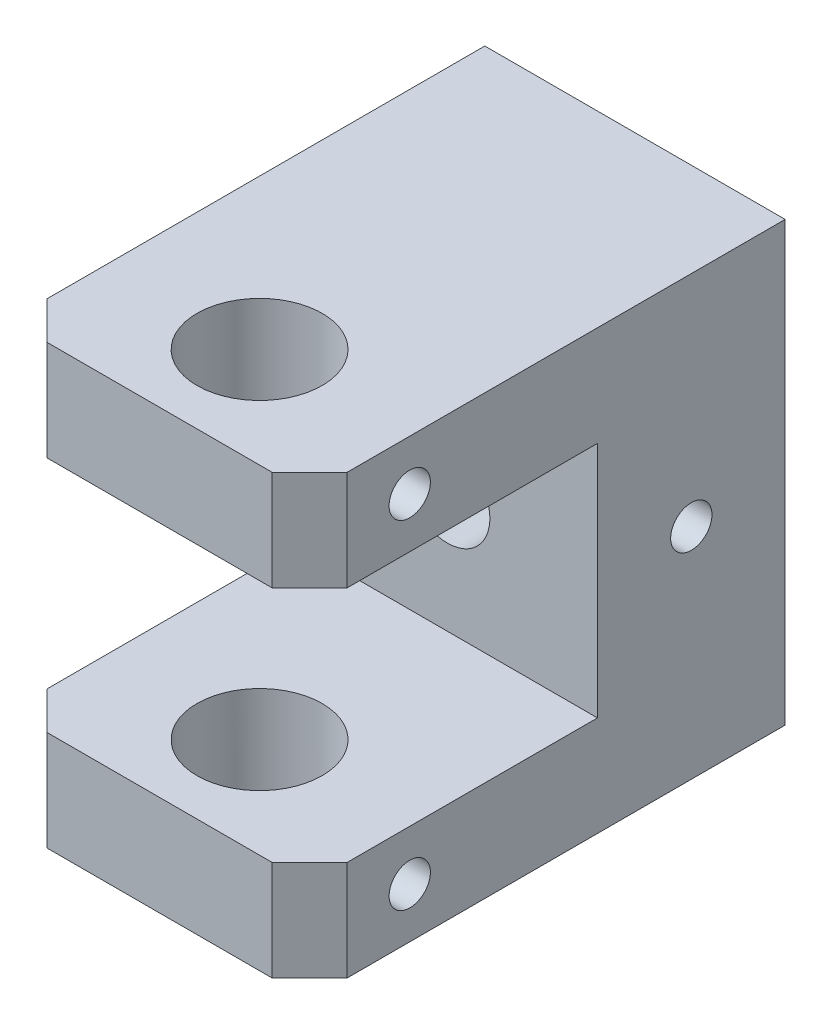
from build123d import *

# Parameters (mm, degrees)
SKETCH_1_W              = 24
SKETCH_1_H              = 38
EXTRUDE_1_DEPTH         = 17.5
SKETCH_2_W              = 23
SKETCH_2_H              = 19
CUT_EXTRUDE_1_DEPTH     = 49.231213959
HOLE_WIZARD_10_0_10_1_D = 10
HOLE_WIZARD_M8_1_D      = 6.8
HOLE_WIZARD_M8_1_DEPTH  = 19.75
HOLE_WIZARD_M8_1_TIP    = 2.042926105
HOLE_WIZARD_M4_1_REACH  = 50.231
HOLE_WIZARD_M4_1_BORE_R = 1.65
CHAMFER_1_SIZE          = 3
HOLE_WIZARD_M4_2_REACH  = 50.231
HOLE_WIZARD_M4_2_BORE_R = 1.65


with BuildPart() as part:
    # Sketch 1 → Extrude 1 (new, symmetric)
    with BuildSketch(Plane(origin=(0, 0, 0), x_dir=(1, 0, 0), z_dir=(0, 1, 0))):
        with Locations((0, -19)):
            Rectangle(SKETCH_1_W, SKETCH_1_H)
    extrude(amount=EXTRUDE_1_DEPTH, both=True)

    # Sketch 2 → Cut-Extrude 1 (cut, through all)
    with BuildSketch(Plane(origin=(12, 0, 0), x_dir=(0, 0, -1), z_dir=(1, 0, 0))):
        with Locations((-26.5, 0)):
            Rectangle(SKETCH_2_W, SKETCH_2_H)
    extrude(amount=-CUT_EXTRUDE_1_DEPTH, mode=Mode.SUBTRACT)

    # Hole Wizard 10.0 _10_ _1 (through all)
    with Locations(Plane(origin=(0, 17.5, 0), x_dir=(1, 0, 0), z_dir=(0, 1, 0))):
        with Locations((0, -30)):
            Hole(HOLE_WIZARD_10_0_10_1_D / 2)

    # Hole Wizard M8 _1
    with Locations(Plane(origin=(0, 0, 0), x_dir=(-1, 0, 0), z_dir=(0, 0, -1))):
        with Locations((0, 0)):
            Hole(HOLE_WIZARD_M8_1_D / 2, depth=HOLE_WIZARD_M8_1_DEPTH)
            with Locations((0, 0, -(HOLE_WIZARD_M8_1_DEPTH + HOLE_WIZARD_M8_1_TIP / 2))):  # 118° drill point
                Cone(0, HOLE_WIZARD_M8_1_D / 2, HOLE_WIZARD_M8_1_TIP, mode=Mode.SUBTRACT)

    # Hole Wizard M4 _1 bore → Hole Wizard M4 _1 (cut, up to next)
    with BuildSketch(Plane(origin=(12, 0, 0), x_dir=(0, 0, -1), z_dir=(1, 0, 0)), mode=Mode.PRIVATE) as hole_wizard_m4_1_sk1:
        with Locations((-30, 13.5)):
            Circle(HOLE_WIZARD_M4_1_BORE_R)
    hole_wizard_m4_1_tool1 = extrude(hole_wizard_m4_1_sk1.sketch, amount=-HOLE_WIZARD_M4_1_REACH, mode=Mode.PRIVATE) & part.part
    # Hole Wizard M4 _1 bore → Hole Wizard M4 _1 (cut, up to next)
    with BuildSketch(Plane(origin=(12, 0, 0), x_dir=(0, 0, -1), z_dir=(1, 0, 0)), mode=Mode.PRIVATE) as hole_wizard_m4_1_sk2:
        with Locations((-30, -13.5)):
            Circle(HOLE_WIZARD_M4_1_BORE_R)
    hole_wizard_m4_1_tool2 = extrude(hole_wizard_m4_1_sk2.sketch, amount=-HOLE_WIZARD_M4_1_REACH, mode=Mode.PRIVATE) & part.part
    add(hole_wizard_m4_1_tool1.solids().sort_by_distance((12, 13.5, 30))[0], mode=Mode.SUBTRACT)
    add(hole_wizard_m4_1_tool2.solids().sort_by_distance((12, -13.5, 30))[0], mode=Mode.SUBTRACT)

    # Chamfer 1
    chamfer_1_edges = [part.edges().sort_by_distance(p)[0] for p in [
        (12, -13.5, 38),
        (-12, -13.5, 38),
        (12, 13.5, 38),
        (-12, 13.5, 38),
    ]]
    chamfer(chamfer_1_edges, length=CHAMFER_1_SIZE)

    # Hole Wizard M4 _2 bore → Hole Wizard M4 _2 (cut, up to next)
    with BuildSketch(Plane(origin=(12, 0, 0), x_dir=(0, 0, -1), z_dir=(1, 0, 0)), mode=Mode.PRIVATE) as hole_wizard_m4_2_sk1:
        with Locations((-7.5, 0)):
            Circle(HOLE_WIZARD_M4_2_BORE_R)
    hole_wizard_m4_2_tool1 = extrude(hole_wizard_m4_2_sk1.sketch, amount=-HOLE_WIZARD_M4_2_REACH, mode=Mode.PRIVATE) & part.part
    add(hole_wizard_m4_2_tool1.solids().sort_by_distance((12, 0, 7.5))[0], mode=Mode.SUBTRACT)


solid = part.part
